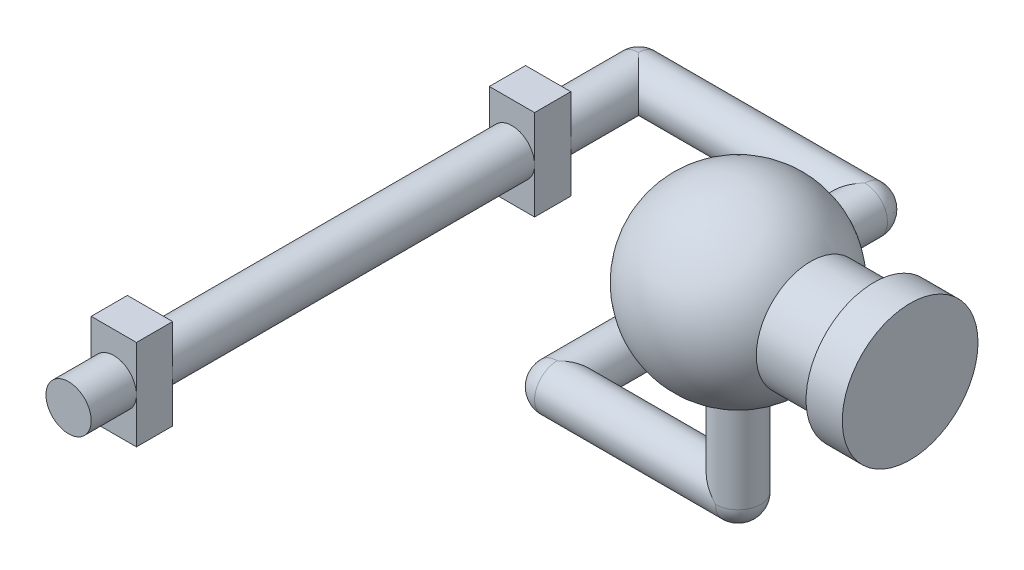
ISO-10303-21;
HEADER;
FILE_DESCRIPTION(('STEP AP214'),'2;1');
FILE_NAME('part.step','',(''),(''),'','','');
FILE_SCHEMA(('AUTOMOTIVE_DESIGN { 1 0 10303 214 1 1 1 1 }'));
ENDSEC;
DATA;
#1=APPLICATION_CONTEXT('core data for automotive mechanical design processes');
#2=APPLICATION_PROTOCOL_DEFINITION('international standard','automotive_design',2000,#1);
#3=PRODUCT_CONTEXT('',#1,'mechanical');
#4=PRODUCT('Part','Part','',(#3));
#5=PRODUCT_RELATED_PRODUCT_CATEGORY('part','',(#4));
#6=PRODUCT_DEFINITION_FORMATION('','',#4);
#7=PRODUCT_DEFINITION_CONTEXT('part definition',#1,'design');
#8=PRODUCT_DEFINITION('design','',#6,#7);
#9=PRODUCT_DEFINITION_SHAPE('','',#8);
#10=(LENGTH_UNIT() NAMED_UNIT(*) SI_UNIT(.MILLI.,.METRE.));
#11=(NAMED_UNIT(*) PLANE_ANGLE_UNIT() SI_UNIT($,.RADIAN.));
#12=(NAMED_UNIT(*) SI_UNIT($,.STERADIAN.) SOLID_ANGLE_UNIT());
#13=UNCERTAINTY_MEASURE_WITH_UNIT(LENGTH_MEASURE(1.E-05),#10,'distance_accuracy_value','');
#14=(GEOMETRIC_REPRESENTATION_CONTEXT(3) GLOBAL_UNCERTAINTY_ASSIGNED_CONTEXT((#13)) GLOBAL_UNIT_ASSIGNED_CONTEXT((#10,
#11,#12)) REPRESENTATION_CONTEXT('',''));
#15=CARTESIAN_POINT('',(0.,0.,0.));
#16=DIRECTION('',(0.,0.,1.));
#17=DIRECTION('',(1.,0.,0.));
#18=AXIS2_PLACEMENT_3D('',#15,#16,#17);
#19=CARTESIAN_POINT('',(45.,20.,-24.));
#20=DIRECTION('',(0.,0.,-1.));
#21=DIRECTION('',(1.,0.,0.));
#22=AXIS2_PLACEMENT_3D('',#19,#20,#21);
#23=SPHERICAL_SURFACE('',#22,10.);
#24=CARTESIAN_POINT('',(53.,20.,-24.));
#25=DIRECTION('',(-1.,0.,0.));
#26=DIRECTION('',(0.,0.,1.));
#27=AXIS2_PLACEMENT_3D('',#24,#25,#26);
#28=CIRCLE('',#27,6.);
#29=CARTESIAN_POINT('',(53.,20.,-18.));
#30=VERTEX_POINT('',#29);
#31=EDGE_CURVE('E452',#30,#30,#28,.F.);
#32=ORIENTED_EDGE('',*,*,#31,.F.);
#33=EDGE_LOOP('',(#32));
#34=FACE_BOUND('',#33,.T.);
#35=CARTESIAN_POINT('',(45.,10.3175416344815,-24.));
#36=DIRECTION('',(0.,1.,0.));
#37=DIRECTION('',(0.,0.,1.));
#38=AXIS2_PLACEMENT_3D('',#35,#36,#37);
#39=CIRCLE('',#38,2.5);
#40=CARTESIAN_POINT('',(45.,10.3175416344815,-21.5));
#41=VERTEX_POINT('',#40);
#42=EDGE_CURVE('E449',#41,#41,#39,.T.);
#43=ORIENTED_EDGE('',*,*,#42,.T.);
#44=EDGE_LOOP('',(#43));
#45=FACE_BOUND('',#44,.T.);
#46=CARTESIAN_POINT('',(45.,15.3639204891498,-24.));
#47=DIRECTION('',(0.,1.,0.));
#48=DIRECTION('',(0.,0.,1.));
#49=AXIS2_PLACEMENT_3D('',#46,#47,#48);
#50=CIRCLE('',#49,8.86040443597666);
#51=CARTESIAN_POINT('',(41.8204007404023,15.3639204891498,-32.2702427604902));
#52=VERTEX_POINT('',#51);
#53=CARTESIAN_POINT('',(40.5164851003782,15.3639204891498,-31.6423073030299));
#54=VERTEX_POINT('',#53);
#55=EDGE_CURVE('E11',#52,#54,#50,.T.);
#56=ORIENTED_EDGE('',*,*,#55,.F.);
#57=CARTESIAN_POINT('',(41.8204007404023,20.,-24.));
#58=DIRECTION('',(-1.,0.,0.));
#59=DIRECTION('',(0.,0.,1.));
#60=AXIS2_PLACEMENT_3D('',#57,#58,#59);
#61=CIRCLE('',#60,9.48104153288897);
#62=CARTESIAN_POINT('',(41.8204007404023,23.187414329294,-32.929195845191));
#63=VERTEX_POINT('',#62);
#64=EDGE_CURVE('E455',#63,#52,#61,.T.);
#65=ORIENTED_EDGE('',*,*,#64,.F.);
#66=CARTESIAN_POINT('',(43.0145541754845,19.3776680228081,-24.));
#67=DIRECTION('',(0.954222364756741,0.299098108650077,0.));
#68=DIRECTION('',(-0.299098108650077,0.954222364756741,0.));
#69=AXIS2_PLACEMENT_3D('',#66,#67,#68);
#70=CIRCLE('',#69,9.78114041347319);
#71=CARTESIAN_POINT('',(44.2726511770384,15.3639204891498,-32.8305000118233));
#72=VERTEX_POINT('',#71);
#73=EDGE_CURVE('E457',#72,#63,#70,.T.);
#74=ORIENTED_EDGE('',*,*,#73,.F.);
#75=CARTESIAN_POINT('',(45.,15.3639204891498,-24.));
#76=DIRECTION('',(0.,1.,0.));
#77=DIRECTION('',(0.,0.,1.));
#78=AXIS2_PLACEMENT_3D('',#75,#76,#77);
#79=CIRCLE('',#78,8.86040443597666);
#80=CARTESIAN_POINT('',(45.6358357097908,15.3639204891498,-32.8375607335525));
#81=VERTEX_POINT('',#80);
#82=EDGE_CURVE('E459',#81,#72,#79,.T.);
#83=ORIENTED_EDGE('',*,*,#82,.F.);
#84=CARTESIAN_POINT('',(46.9080454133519,19.3983152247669,-24.));
#85=DIRECTION('',(-0.953705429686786,0.300742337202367,0.));
#86=DIRECTION('',(-0.300742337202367,-0.953705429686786,0.));
#87=AXIS2_PLACEMENT_3D('',#84,#85,#86);
#88=CIRCLE('',#87,9.79782313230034);
#89=CARTESIAN_POINT('',(48.102903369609,23.187414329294,-32.9561364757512));
#90=VERTEX_POINT('',#89);
#91=EDGE_CURVE('E461',#90,#81,#88,.T.);
#92=ORIENTED_EDGE('',*,*,#91,.F.);
#93=CARTESIAN_POINT('',(48.102903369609,20.,-24.));
#94=DIRECTION('',(1.,0.,0.));
#95=DIRECTION('',(0.,0.,-1.));
#96=AXIS2_PLACEMENT_3D('',#93,#94,#95);
#97=CIRCLE('',#96,9.50641839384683);
#98=CARTESIAN_POINT('',(48.102903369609,15.3639204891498,-32.2993227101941));
#99=VERTEX_POINT('',#98);
#100=EDGE_CURVE('E463',#99,#90,#97,.T.);
#101=ORIENTED_EDGE('',*,*,#100,.F.);
#102=CARTESIAN_POINT('',(45.,15.3639204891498,-24.));
#103=DIRECTION('',(0.,1.,0.));
#104=DIRECTION('',(0.,0.,1.));
#105=AXIS2_PLACEMENT_3D('',#102,#103,#104);
#106=CIRCLE('',#105,8.86040443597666);
#107=CARTESIAN_POINT('',(49.406819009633,15.3639204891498,-31.6867882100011));
#108=VERTEX_POINT('',#107);
#109=EDGE_CURVE('E465',#108,#99,#106,.T.);
#110=ORIENTED_EDGE('',*,*,#109,.F.);
#111=CARTESIAN_POINT('',(49.406819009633,20.,-24.));
#112=DIRECTION('',(-1.,0.,0.));
#113=DIRECTION('',(0.,0.,1.));
#114=AXIS2_PLACEMENT_3D('',#111,#112,#113);
#115=CIRCLE('',#114,8.97663334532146);
#116=CARTESIAN_POINT('',(49.406819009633,24.6098677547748,-31.7025363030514));
#117=VERTEX_POINT('',#116);
#118=EDGE_CURVE('E467',#117,#108,#115,.T.);
#119=ORIENTED_EDGE('',*,*,#118,.F.);
#120=CARTESIAN_POINT('',(45.,24.6098677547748,-24.));
#121=DIRECTION('',(0.,-1.,0.));
#122=DIRECTION('',(0.,0.,-1.));
#123=AXIS2_PLACEMENT_3D('',#120,#121,#122);
#124=CIRCLE('',#123,8.87407005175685);
#125=CARTESIAN_POINT('',(47.4620584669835,24.6098677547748,-32.5256898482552));
#126=VERTEX_POINT('',#125);
#127=EDGE_CURVE('E469',#126,#117,#124,.T.);
#128=ORIENTED_EDGE('',*,*,#127,.F.);
#129=CARTESIAN_POINT('',(45.8908068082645,19.7141035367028,-24.));
#130=DIRECTION('',(0.952163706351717,-0.305588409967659,0.));
#131=DIRECTION('',(0.305588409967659,0.952163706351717,0.));
#132=AXIS2_PLACEMENT_3D('',#129,#130,#131);
#133=CIRCLE('',#132,9.95614013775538);
#134=CARTESIAN_POINT('',(45.4154295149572,18.2329053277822,-33.8338596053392));
#135=VERTEX_POINT('',#134);
#136=EDGE_CURVE('E470',#135,#126,#133,.T.);
#137=ORIENTED_EDGE('',*,*,#136,.F.);
#138=CARTESIAN_POINT('',(44.9616520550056,16.7641480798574,-33.4619126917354));
#139=CARTESIAN_POINT('',(44.9660644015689,16.7791286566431,-33.4670537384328));
#140=CARTESIAN_POINT('',(44.970476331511,16.7941225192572,-33.4721564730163));
#141=CARTESIAN_POINT('',(44.9793212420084,16.8241305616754,-33.4822832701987));
#142=CARTESIAN_POINT('',(44.983754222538,16.8391447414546,-33.4873073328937));
#143=CARTESIAN_POINT('',(44.9971176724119,16.8842087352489,-33.5022585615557));
#144=CARTESIAN_POINT('',(45.006112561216,16.914279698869,-33.5120646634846));
#145=CARTESIAN_POINT('',(45.0242074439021,16.974488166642,-33.5313573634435));
#146=CARTESIAN_POINT('',(45.0333074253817,17.0046256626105,-33.5408439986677));
#147=CARTESIAN_POINT('',(45.0513297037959,17.065044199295,-33.559523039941));
#148=CARTESIAN_POINT('',(45.0602520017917,17.0953252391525,-33.5687154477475));
#149=CARTESIAN_POINT('',(45.0782742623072,17.1559305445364,-33.5867733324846));
#150=CARTESIAN_POINT('',(45.0873742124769,17.1862548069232,-33.5956388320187));
#151=CARTESIAN_POINT('',(45.1060754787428,17.2468510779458,-33.6130120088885));
#152=CARTESIAN_POINT('',(45.1156767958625,17.2771230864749,-33.6215196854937));
#153=CARTESIAN_POINT('',(45.1349712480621,17.3377248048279,-33.6382132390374));
#154=CARTESIAN_POINT('',(45.1446643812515,17.3680545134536,-33.6463991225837));
#155=CARTESIAN_POINT('',(45.1638675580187,17.4288500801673,-33.6624746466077));
#156=CARTESIAN_POINT('',(45.1733776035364,17.4593159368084,-33.6703642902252));
#157=CARTESIAN_POINT('',(45.1923293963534,17.5205412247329,-33.685885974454));
#158=CARTESIAN_POINT('',(45.2017704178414,17.5513013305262,-33.6935162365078));
#159=CARTESIAN_POINT('',(45.2205693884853,17.6129219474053,-33.7084654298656));
#160=CARTESIAN_POINT('',(45.2299273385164,17.6437824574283,-33.7157843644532));
#161=CARTESIAN_POINT('',(45.2487561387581,17.7055451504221,-33.7300920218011));
#162=CARTESIAN_POINT('',(45.2582269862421,17.7364473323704,-33.7370807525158));
#163=CARTESIAN_POINT('',(45.2774910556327,17.7982286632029,-33.7507074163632));
#164=CARTESIAN_POINT('',(45.2872842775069,17.8291078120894,-33.7573453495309));
#165=CARTESIAN_POINT('',(45.307055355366,17.8909327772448,-33.7702942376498));
#166=CARTESIAN_POINT('',(45.3170334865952,17.9218786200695,-33.7766046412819));
#167=CARTESIAN_POINT('',(45.3369289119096,17.9838529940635,-33.7889083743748));
#168=CARTESIAN_POINT('',(45.3468462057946,18.0148815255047,-33.7949017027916));
#169=CARTESIAN_POINT('',(45.3665603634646,18.077036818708,-33.8065765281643));
#170=CARTESIAN_POINT('',(45.3763572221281,18.1081635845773,-33.8122580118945));
#171=CARTESIAN_POINT('',(45.3959070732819,18.1704879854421,-33.8233008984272));
#172=CARTESIAN_POINT('',(45.4056600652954,18.2016856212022,-33.8286622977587));
#173=CARTESIAN_POINT('',(45.4154295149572,18.2329053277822,-33.8338596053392));
#174=B_SPLINE_CURVE_WITH_KNOTS('',3,(#138,#139,#140,#141,#142,#143,#144,#145,#146,#147,#148,
#149,#150,#151,#152,#153,#154,#155,#156,#157,#158,#159,#160,#161,#162,#163,#164,#165,#166,#167,
#168,#169,#170,#171,#172,#173),.UNSPECIFIED.,.F.,.F.,(4,2,2,2,2,2,2,2,2,2,2,2,2,2,2,2,2,4),(0.,
0.0493239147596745,0.0986477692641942,0.197296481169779,0.295933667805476,0.394570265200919,
0.493200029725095,0.591829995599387,0.690457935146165,0.789084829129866,0.88828913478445,
0.987492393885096,1.08669326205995,1.18589412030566,1.28525687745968,1.38461996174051,
1.48398725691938,1.5833556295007),.UNSPECIFIED.);
#175=CARTESIAN_POINT('',(44.9616520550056,16.7641480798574,-33.4619126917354));
#176=VERTEX_POINT('',#175);
#177=EDGE_CURVE('E338',#176,#135,#174,.T.);
#178=ORIENTED_EDGE('',*,*,#177,.F.);
#179=CARTESIAN_POINT('',(44.5449176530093,18.1217761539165,-33.8114818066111));
#180=CARTESIAN_POINT('',(44.5537796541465,18.0931494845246,-33.8064128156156));
#181=CARTESIAN_POINT('',(44.5626317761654,18.0645441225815,-33.8012062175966));
#182=CARTESIAN_POINT('',(44.5803554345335,18.0073903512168,-33.7905224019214));
#183=CARTESIAN_POINT('',(44.5892269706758,17.9788419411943,-33.7850451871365));
#184=CARTESIAN_POINT('',(44.6070293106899,17.9218142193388,-33.7738243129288));
#185=CARTESIAN_POINT('',(44.6159601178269,17.8933349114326,-33.7680806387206));
#186=CARTESIAN_POINT('',(44.6338739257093,17.836447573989,-33.7563269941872));
#187=CARTESIAN_POINT('',(44.6428569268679,17.8080395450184,-33.7503170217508));
#188=CARTESIAN_POINT('',(44.6653115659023,17.7369551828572,-33.7349218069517));
#189=CARTESIAN_POINT('',(44.6787618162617,17.6943094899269,-33.7253631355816));
#190=CARTESIAN_POINT('',(44.7054295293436,17.6090921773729,-33.7056106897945));
#191=CARTESIAN_POINT('',(44.7186469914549,17.566520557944,-33.6954169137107));
#192=CARTESIAN_POINT('',(44.7447869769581,17.4814441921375,-33.6743906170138));
#193=CARTESIAN_POINT('',(44.7577094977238,17.4389394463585,-33.6635580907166));
#194=CARTESIAN_POINT('',(44.7771010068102,17.3753044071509,-33.6468550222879));
#195=CARTESIAN_POINT('',(44.7835661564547,17.3541129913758,-33.641211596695));
#196=CARTESIAN_POINT('',(44.7965513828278,17.3117863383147,-33.6297787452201));
#197=CARTESIAN_POINT('',(44.8030714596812,17.2906511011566,-33.6239893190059));
#198=CARTESIAN_POINT('',(44.8161162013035,17.2483500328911,-33.6122388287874));
#199=CARTESIAN_POINT('',(44.8226408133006,17.2271843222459,-33.6062772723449));
#200=CARTESIAN_POINT('',(44.8355760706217,17.1848646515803,-33.5941911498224));
#201=CARTESIAN_POINT('',(44.841986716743,17.1637106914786,-33.5880665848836));
#202=CARTESIAN_POINT('',(44.8546876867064,17.1214147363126,-33.5756544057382));
#203=CARTESIAN_POINT('',(44.8609780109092,17.1002727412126,-33.5693667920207));
#204=CARTESIAN_POINT('',(44.8735928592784,17.058043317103,-33.556643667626));
#205=CARTESIAN_POINT('',(44.8799173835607,17.0369558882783,-33.5502081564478));
#206=CARTESIAN_POINT('',(44.8927147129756,16.994867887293,-33.537200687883));
#207=CARTESIAN_POINT('',(44.8991875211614,16.9738673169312,-33.5306287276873));
#208=CARTESIAN_POINT('',(44.912091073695,16.9319022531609,-33.5173302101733));
#209=CARTESIAN_POINT('',(44.9185218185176,16.9109377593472,-33.510603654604));
#210=CARTESIAN_POINT('',(44.9311389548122,16.8689923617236,-33.4969771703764));
#211=CARTESIAN_POINT('',(44.9373253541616,16.848011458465,-33.490077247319));
#212=CARTESIAN_POINT('',(44.9495630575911,16.8060620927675,-33.4761143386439));
#213=CARTESIAN_POINT('',(44.9556143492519,16.7850936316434,-33.4690513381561));
#214=CARTESIAN_POINT('',(44.9616520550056,16.7641480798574,-33.4619126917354));
#215=B_SPLINE_CURVE_WITH_KNOTS('',3,(#179,#180,#181,#182,#183,#184,#185,#186,#187,#188,#189,
#190,#191,#192,#193,#194,#195,#196,#197,#198,#199,#200,#201,#202,#203,#204,#205,#206,#207,#208,
#209,#210,#211,#212,#213,#214),.UNSPECIFIED.,.F.,.F.,(4,2,2,2,2,2,2,2,2,2,2,2,2,2,2,2,2,4),(0.,
0.0911777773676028,0.18235458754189,0.273536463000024,0.364719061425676,0.501894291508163,
0.639069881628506,0.776246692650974,0.844835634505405,0.913424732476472,0.982234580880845,
1.05104394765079,1.1198531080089,1.18866250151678,1.25747331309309,1.32628334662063,
1.39509116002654,1.46390527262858),.UNSPECIFIED.);
#216=CARTESIAN_POINT('',(44.5449176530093,18.1217761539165,-33.8114818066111));
#217=VERTEX_POINT('',#216);
#218=EDGE_CURVE('E330',#217,#176,#215,.T.);
#219=ORIENTED_EDGE('',*,*,#218,.F.);
#220=CARTESIAN_POINT('',(44.0436145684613,19.69531083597,-24.));
#221=DIRECTION('',(-0.95281497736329,-0.303551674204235,0.));
#222=DIRECTION('',(0.303551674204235,-0.95281497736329,0.));
#223=AXIS2_PLACEMENT_3D('',#220,#221,#222);
#224=CIRCLE('',#223,9.94949704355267);
#225=CARTESIAN_POINT('',(42.4779150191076,24.6098677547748,-32.5081259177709));
#226=VERTEX_POINT('',#225);
#227=EDGE_CURVE('E337',#226,#217,#224,.T.);
#228=ORIENTED_EDGE('',*,*,#227,.F.);
#229=CARTESIAN_POINT('',(45.,24.6098677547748,-24.));
#230=DIRECTION('',(0.,-1.,0.));
#231=DIRECTION('',(0.,0.,-1.));
#232=AXIS2_PLACEMENT_3D('',#229,#230,#231);
#233=CIRCLE('',#232,8.87407005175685);
#234=CARTESIAN_POINT('',(40.5164851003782,24.6098677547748,-31.6581468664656));
#235=VERTEX_POINT('',#234);
#236=EDGE_CURVE('E906',#235,#226,#233,.T.);
#237=ORIENTED_EDGE('',*,*,#236,.F.);
#238=CARTESIAN_POINT('',(40.5164851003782,20.,-24.));
#239=DIRECTION('',(1.,0.,0.));
#240=DIRECTION('',(0.,0.,-1.));
#241=AXIS2_PLACEMENT_3D('',#238,#239,#240);
#242=CIRCLE('',#241,8.93857338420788);
#243=EDGE_CURVE('E40',#54,#235,#242,.T.);
#244=ORIENTED_EDGE('',*,*,#243,.F.);
#245=EDGE_LOOP('',(#56,#65,#74,#83,#92,#101,#110,#119,#128,#137,#178,#219,#228,#237,#244));
#246=FACE_BOUND('',#245,.T.);
#247=ADVANCED_FACE('F32',(#34,#45,#246),#23,.T.);
#248=CARTESIAN_POINT('',(45.,20.,-24.));
#249=DIRECTION('',(0.,-1.,0.));
#250=DIRECTION('',(0.,0.,-1.));
#251=AXIS2_PLACEMENT_3D('',#248,#249,#250);
#252=CYLINDRICAL_SURFACE('',#251,2.5);
#253=CARTESIAN_POINT('',(45.,0.,-24.));
#254=DIRECTION('',(0.,1.,0.));
#255=DIRECTION('',(0.,0.,1.));
#256=AXIS2_PLACEMENT_3D('',#253,#254,#255);
#257=CIRCLE('',#256,2.5);
#258=CARTESIAN_POINT('',(45.,0.,-21.5));
#259=VERTEX_POINT('',#258);
#260=CARTESIAN_POINT('',(45.,0.,-26.5));
#261=VERTEX_POINT('',#260);
#262=EDGE_CURVE('E520',#259,#261,#257,.T.);
#263=ORIENTED_EDGE('',*,*,#262,.T.);
#264=CARTESIAN_POINT('',(45.,0.,-24.));
#265=DIRECTION('',(-0.707106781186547,-0.707106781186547,0.));
#266=DIRECTION('',(-0.707106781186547,0.707106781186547,0.));
#267=AXIS2_PLACEMENT_3D('',#264,#265,#266);
#268=ELLIPSE('',#267,3.53553390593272,2.49999999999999);
#269=EDGE_CURVE('E523',#261,#259,#268,.F.);
#270=ORIENTED_EDGE('',*,*,#269,.T.);
#271=EDGE_LOOP('',(#263,#270));
#272=FACE_BOUND('',#271,.T.);
#273=ORIENTED_EDGE('',*,*,#42,.F.);
#274=EDGE_LOOP('',(#273));
#275=FACE_BOUND('',#274,.T.);
#276=ADVANCED_FACE('F348',(#272,#275),#252,.T.);
#277=CARTESIAN_POINT('',(45.,0.,-24.));
#278=DIRECTION('',(-1.,0.,0.));
#279=DIRECTION('',(0.,0.,1.));
#280=AXIS2_PLACEMENT_3D('',#277,#278,#279);
#281=CYLINDRICAL_SURFACE('',#280,2.49999999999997);
#282=CARTESIAN_POINT('',(25.,0.,-24.));
#283=DIRECTION('',(-0.707106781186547,0.,-0.707106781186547));
#284=DIRECTION('',(0.707106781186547,0.,-0.707106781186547));
#285=AXIS2_PLACEMENT_3D('',#282,#283,#284);
#286=ELLIPSE('',#285,3.53553390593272,2.49999999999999);
#287=CARTESIAN_POINT('',(25.,2.49999999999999,-24.));
#288=VERTEX_POINT('',#287);
#289=CARTESIAN_POINT('',(25.,-2.49999999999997,-24.));
#290=VERTEX_POINT('',#289);
#291=EDGE_CURVE('E531',#288,#290,#286,.T.);
#292=ORIENTED_EDGE('',*,*,#291,.F.);
#293=CARTESIAN_POINT('',(25.,0.,-24.));
#294=DIRECTION('',(1.,0.,0.));
#295=DIRECTION('',(0.,0.,-1.));
#296=AXIS2_PLACEMENT_3D('',#293,#294,#295);
#297=CIRCLE('',#296,2.49999999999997);
#298=EDGE_CURVE('E526',#288,#290,#297,.T.);
#299=ORIENTED_EDGE('',*,*,#298,.T.);
#300=EDGE_LOOP('',(#292,#299));
#301=FACE_BOUND('',#300,.T.);
#302=ORIENTED_EDGE('',*,*,#269,.F.);
#303=CARTESIAN_POINT('',(45.,0.,-24.));
#304=DIRECTION('',(1.,0.,0.));
#305=DIRECTION('',(0.,0.,-1.));
#306=AXIS2_PLACEMENT_3D('',#303,#304,#305);
#307=CIRCLE('',#306,2.49999999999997);
#308=EDGE_CURVE('E529',#259,#261,#307,.T.);
#309=ORIENTED_EDGE('',*,*,#308,.F.);
#310=EDGE_LOOP('',(#302,#309));
#311=FACE_BOUND('',#310,.T.);
#312=ADVANCED_FACE('F355',(#301,#311),#281,.T.);
#313=CARTESIAN_POINT('',(25.,0.,-24.));
#314=DIRECTION('',(0.,0.,-1.));
#315=DIRECTION('',(-1.,0.,0.));
#316=AXIS2_PLACEMENT_3D('',#313,#314,#315);
#317=CYLINDRICAL_SURFACE('',#316,2.5);
#318=CARTESIAN_POINT('',(25.,0.,-58.));
#319=DIRECTION('',(-0.707106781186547,0.,-0.707106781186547));
#320=DIRECTION('',(-0.707106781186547,0.,0.707106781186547));
#321=AXIS2_PLACEMENT_3D('',#318,#319,#320);
#322=ELLIPSE('',#321,3.53553390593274,2.5);
#323=CARTESIAN_POINT('',(25.,-2.5,-58.));
#324=VERTEX_POINT('',#323);
#325=CARTESIAN_POINT('',(25.,2.5,-58.));
#326=VERTEX_POINT('',#325);
#327=EDGE_CURVE('E540',#324,#326,#322,.T.);
#328=ORIENTED_EDGE('',*,*,#327,.F.);
#329=CARTESIAN_POINT('',(25.,0.,-58.));
#330=DIRECTION('',(0.,0.,-1.));
#331=DIRECTION('',(-1.,0.,0.));
#332=AXIS2_PLACEMENT_3D('',#329,#330,#331);
#333=CIRCLE('',#332,2.5);
#334=EDGE_CURVE('E534',#326,#324,#333,.T.);
#335=ORIENTED_EDGE('',*,*,#334,.F.);
#336=EDGE_LOOP('',(#328,#335));
#337=FACE_BOUND('',#336,.T.);
#338=CARTESIAN_POINT('',(25.,0.,-24.));
#339=DIRECTION('',(0.,0.,-1.));
#340=DIRECTION('',(-1.,0.,0.));
#341=AXIS2_PLACEMENT_3D('',#338,#339,#340);
#342=CIRCLE('',#341,2.5);
#343=EDGE_CURVE('E537',#290,#288,#342,.T.);
#344=ORIENTED_EDGE('',*,*,#343,.T.);
#345=ORIENTED_EDGE('',*,*,#291,.T.);
#346=EDGE_LOOP('',(#344,#345));
#347=FACE_BOUND('',#346,.T.);
#348=ADVANCED_FACE('F359',(#337,#347),#317,.T.);
#349=CARTESIAN_POINT('',(0.,0.,-58.));
#350=DIRECTION('',(0.,0.,1.));
#351=DIRECTION('',(1.,0.,0.));
#352=AXIS2_PLACEMENT_3D('',#349,#350,#351);
#353=CYLINDRICAL_SURFACE('',#352,2.5);
#354=CARTESIAN_POINT('',(0.,0.,-48.));
#355=DIRECTION('',(0.,0.,-1.));
#356=DIRECTION('',(-1.,0.,0.));
#357=AXIS2_PLACEMENT_3D('',#354,#355,#356);
#358=CIRCLE('',#357,2.5);
#359=CARTESIAN_POINT('',(-2.5,0.,-48.));
#360=VERTEX_POINT('',#359);
#361=CARTESIAN_POINT('',(2.5,0.,-48.));
#362=VERTEX_POINT('',#361);
#363=EDGE_CURVE('E551',#360,#362,#358,.T.);
#364=ORIENTED_EDGE('',*,*,#363,.T.);
#365=EDGE_CURVE('E55',#362,#360,#358,.T.);
#366=ORIENTED_EDGE('',*,*,#365,.T.);
#367=EDGE_LOOP('',(#364,#366));
#368=FACE_BOUND('',#367,.T.);
#369=CARTESIAN_POINT('',(0.,0.,-58.));
#370=DIRECTION('',(-0.707106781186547,0.,0.707106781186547));
#371=DIRECTION('',(0.707106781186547,0.,0.707106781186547));
#372=AXIS2_PLACEMENT_3D('',#369,#370,#371);
#373=ELLIPSE('',#372,3.53553390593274,2.5);
#374=CARTESIAN_POINT('',(0.,2.5,-58.));
#375=VERTEX_POINT('',#374);
#376=CARTESIAN_POINT('',(0.,-2.5,-58.));
#377=VERTEX_POINT('',#376);
#378=EDGE_CURVE('E548',#375,#377,#373,.F.);
#379=ORIENTED_EDGE('',*,*,#378,.F.);
#380=CARTESIAN_POINT('',(0.,0.,-58.));
#381=DIRECTION('',(0.,0.,-1.));
#382=DIRECTION('',(-1.,0.,0.));
#383=AXIS2_PLACEMENT_3D('',#380,#381,#382);
#384=CIRCLE('',#383,2.5);
#385=EDGE_CURVE('E554',#377,#375,#384,.T.);
#386=ORIENTED_EDGE('',*,*,#385,.F.);
#387=EDGE_LOOP('',(#379,#386));
#388=FACE_BOUND('',#387,.T.);
#389=ADVANCED_FACE('F363',(#368,#388),#353,.T.);
#390=CARTESIAN_POINT('',(2.5,-5.,-48.));
#391=DIRECTION('',(0.,0.,-1.));
#392=DIRECTION('',(-1.,0.,0.));
#393=AXIS2_PLACEMENT_3D('',#390,#391,#392);
#394=PLANE('',#393);
#395=ORIENTED_EDGE('',*,*,#363,.F.);
#396=DIRECTION('',(0.,1.,0.));
#397=VECTOR('',#396,1.);
#398=CARTESIAN_POINT('',(-2.5,5.,-48.));
#399=LINE('',#398,#397);
#400=CARTESIAN_POINT('',(-2.5,5.,-48.));
#401=VERTEX_POINT('',#400);
#402=EDGE_CURVE('E574',#360,#401,#399,.T.);
#403=ORIENTED_EDGE('',*,*,#402,.T.);
#404=DIRECTION('',(1.,0.,0.));
#405=VECTOR('',#404,1.);
#406=CARTESIAN_POINT('',(2.5,5.,-48.));
#407=LINE('',#406,#405);
#408=CARTESIAN_POINT('',(2.5,5.,-48.));
#409=VERTEX_POINT('',#408);
#410=EDGE_CURVE('E577',#401,#409,#407,.T.);
#411=ORIENTED_EDGE('',*,*,#410,.T.);
#412=DIRECTION('',(0.,-1.,0.));
#413=VECTOR('',#412,1.);
#414=CARTESIAN_POINT('',(2.5,5.,-48.));
#415=LINE('',#414,#413);
#416=EDGE_CURVE('E569',#409,#362,#415,.T.);
#417=ORIENTED_EDGE('',*,*,#416,.T.);
#418=EDGE_LOOP('',(#395,#403,#411,#417));
#419=FACE_BOUND('',#418,.T.);
#420=ADVANCED_FACE('F372',(#419),#394,.T.);
#421=CARTESIAN_POINT('',(2.5,-5.,-4.));
#422=DIRECTION('',(0.,0.,-1.));
#423=DIRECTION('',(-1.,0.,0.));
#424=AXIS2_PLACEMENT_3D('',#421,#422,#423);
#425=PLANE('',#424);
#426=CARTESIAN_POINT('',(0.,0.,-4.));
#427=DIRECTION('',(0.,0.,-1.));
#428=DIRECTION('',(-1.,0.,0.));
#429=AXIS2_PLACEMENT_3D('',#426,#427,#428);
#430=CIRCLE('',#429,2.5);
#431=CARTESIAN_POINT('',(-2.5,0.,-4.));
#432=VERTEX_POINT('',#431);
#433=CARTESIAN_POINT('',(2.5,0.,-4.));
#434=VERTEX_POINT('',#433);
#435=EDGE_CURVE('E443',#432,#434,#430,.T.);
#436=ORIENTED_EDGE('',*,*,#435,.F.);
#437=DIRECTION('',(0.,1.,0.));
#438=VECTOR('',#437,1.);
#439=CARTESIAN_POINT('',(-2.5,5.,-4.));
#440=LINE('',#439,#438);
#441=CARTESIAN_POINT('',(-2.5,5.,-4.));
#442=VERTEX_POINT('',#441);
#443=EDGE_CURVE('E613',#432,#442,#440,.T.);
#444=ORIENTED_EDGE('',*,*,#443,.T.);
#445=DIRECTION('',(1.,0.,0.));
#446=VECTOR('',#445,1.);
#447=CARTESIAN_POINT('',(2.5,5.,-4.));
#448=LINE('',#447,#446);
#449=CARTESIAN_POINT('',(2.5,5.,-4.));
#450=VERTEX_POINT('',#449);
#451=EDGE_CURVE('E616',#442,#450,#448,.T.);
#452=ORIENTED_EDGE('',*,*,#451,.T.);
#453=DIRECTION('',(0.,-1.,0.));
#454=VECTOR('',#453,1.);
#455=CARTESIAN_POINT('',(2.5,5.,-4.));
#456=LINE('',#455,#454);
#457=EDGE_CURVE('E608',#450,#434,#456,.T.);
#458=ORIENTED_EDGE('',*,*,#457,.T.);
#459=EDGE_LOOP('',(#436,#444,#452,#458));
#460=FACE_BOUND('',#459,.T.);
#461=ADVANCED_FACE('F411',(#460),#425,.T.);
#462=CARTESIAN_POINT('',(0.,0.,5.));
#463=DIRECTION('',(0.,0.,-1.));
#464=DIRECTION('',(-1.,0.,0.));
#465=AXIS2_PLACEMENT_3D('',#462,#463,#464);
#466=CYLINDRICAL_SURFACE('',#465,2.5);
#467=CARTESIAN_POINT('',(0.,0.,5.));
#468=DIRECTION('',(0.,0.,1.));
#469=DIRECTION('',(1.,0.,0.));
#470=AXIS2_PLACEMENT_3D('',#467,#468,#469);
#471=CIRCLE('',#470,2.5);
#472=CARTESIAN_POINT('',(2.5,0.,5.));
#473=VERTEX_POINT('',#472);
#474=EDGE_CURVE('E437',#473,#473,#471,.T.);
#475=ORIENTED_EDGE('',*,*,#474,.F.);
#476=EDGE_LOOP('',(#475));
#477=FACE_BOUND('',#476,.T.);
#478=CARTESIAN_POINT('',(0.,0.,0.));
#479=DIRECTION('',(0.,0.,1.));
#480=DIRECTION('',(1.,0.,0.));
#481=AXIS2_PLACEMENT_3D('',#478,#479,#480);
#482=CIRCLE('',#481,2.5);
#483=CARTESIAN_POINT('',(2.5,0.,0.));
#484=VERTEX_POINT('',#483);
#485=CARTESIAN_POINT('',(-2.5,0.,0.));
#486=VERTEX_POINT('',#485);
#487=EDGE_CURVE('E439',#484,#486,#482,.T.);
#488=ORIENTED_EDGE('',*,*,#487,.T.);
#489=EDGE_CURVE('E445',#486,#484,#482,.T.);
#490=ORIENTED_EDGE('',*,*,#489,.T.);
#491=EDGE_LOOP('',(#488,#490));
#492=FACE_BOUND('',#491,.T.);
#493=ADVANCED_FACE('F34',(#477,#492),#466,.T.);
#494=CARTESIAN_POINT('',(0.,0.,5.));
#495=DIRECTION('',(0.,0.,1.));
#496=DIRECTION('',(1.,0.,0.));
#497=AXIS2_PLACEMENT_3D('',#494,#495,#496);
#498=PLANE('',#497);
#499=ORIENTED_EDGE('',*,*,#474,.T.);
#500=EDGE_LOOP('',(#499));
#501=FACE_BOUND('',#500,.T.);
#502=ADVANCED_FACE('F426',(#501),#498,.T.);
#503=CARTESIAN_POINT('',(2.5,-5.,0.));
#504=DIRECTION('',(0.,0.,-1.));
#505=DIRECTION('',(-1.,0.,0.));
#506=AXIS2_PLACEMENT_3D('',#503,#504,#505);
#507=PLANE('',#506);
#508=ORIENTED_EDGE('',*,*,#487,.F.);
#509=DIRECTION('',(0.,-1.,0.));
#510=VECTOR('',#509,1.);
#511=CARTESIAN_POINT('',(2.5,5.,0.));
#512=LINE('',#511,#510);
#513=CARTESIAN_POINT('',(2.5,5.,0.));
#514=VERTEX_POINT('',#513);
#515=EDGE_CURVE('E597',#514,#484,#512,.T.);
#516=ORIENTED_EDGE('',*,*,#515,.F.);
#517=DIRECTION('',(1.,0.,0.));
#518=VECTOR('',#517,1.);
#519=CARTESIAN_POINT('',(2.5,5.,0.));
#520=LINE('',#519,#518);
#521=CARTESIAN_POINT('',(-2.5,5.,0.));
#522=VERTEX_POINT('',#521);
#523=EDGE_CURVE('E605',#522,#514,#520,.T.);
#524=ORIENTED_EDGE('',*,*,#523,.F.);
#525=DIRECTION('',(0.,1.,0.));
#526=VECTOR('',#525,1.);
#527=CARTESIAN_POINT('',(-2.5,5.,0.));
#528=LINE('',#527,#526);
#529=EDGE_CURVE('E601',#486,#522,#528,.T.);
#530=ORIENTED_EDGE('',*,*,#529,.F.);
#531=EDGE_LOOP('',(#508,#516,#524,#530));
#532=FACE_BOUND('',#531,.T.);
#533=ADVANCED_FACE('F406',(#532),#507,.F.);
#534=CARTESIAN_POINT('',(2.5,5.,-4.));
#535=DIRECTION('',(-1.,0.,0.));
#536=DIRECTION('',(0.,-1.,0.));
#537=AXIS2_PLACEMENT_3D('',#534,#535,#536);
#538=PLANE('',#537);
#539=ORIENTED_EDGE('',*,*,#515,.T.);
#540=CARTESIAN_POINT('',(2.5,-5.,0.));
#541=VERTEX_POINT('',#540);
#542=EDGE_CURVE('E596',#484,#541,#512,.T.);
#543=ORIENTED_EDGE('',*,*,#542,.T.);
#544=DIRECTION('',(0.,0.,1.));
#545=VECTOR('',#544,1.);
#546=CARTESIAN_POINT('',(2.5,-5.,-4.));
#547=LINE('',#546,#545);
#548=CARTESIAN_POINT('',(2.5,-5.,-4.));
#549=VERTEX_POINT('',#548);
#550=EDGE_CURVE('E626',#549,#541,#547,.T.);
#551=ORIENTED_EDGE('',*,*,#550,.F.);
#552=EDGE_CURVE('E607',#434,#549,#456,.T.);
#553=ORIENTED_EDGE('',*,*,#552,.F.);
#554=ORIENTED_EDGE('',*,*,#457,.F.);
#555=DIRECTION('',(0.,0.,1.));
#556=VECTOR('',#555,1.);
#557=CARTESIAN_POINT('',(2.5,5.,-4.));
#558=LINE('',#557,#556);
#559=EDGE_CURVE('E618',#450,#514,#558,.T.);
#560=ORIENTED_EDGE('',*,*,#559,.T.);
#561=EDGE_LOOP('',(#539,#543,#551,#553,#554,#560));
#562=FACE_BOUND('',#561,.T.);
#563=ADVANCED_FACE('F422',(#562),#538,.F.);
#564=CARTESIAN_POINT('',(2.5,-5.,-4.));
#565=DIRECTION('',(0.,1.,0.));
#566=DIRECTION('',(0.,0.,1.));
#567=AXIS2_PLACEMENT_3D('',#564,#565,#566);
#568=PLANE('',#567);
#569=DIRECTION('',(-1.,0.,0.));
#570=VECTOR('',#569,1.);
#571=CARTESIAN_POINT('',(2.5,-5.,0.));
#572=LINE('',#571,#570);
#573=CARTESIAN_POINT('',(-2.5,-5.,0.));
#574=VERTEX_POINT('',#573);
#575=EDGE_CURVE('E599',#541,#574,#572,.T.);
#576=ORIENTED_EDGE('',*,*,#575,.T.);
#577=DIRECTION('',(0.,0.,1.));
#578=VECTOR('',#577,1.);
#579=CARTESIAN_POINT('',(-2.5,-5.,-4.));
#580=LINE('',#579,#578);
#581=CARTESIAN_POINT('',(-2.5,-5.,-4.));
#582=VERTEX_POINT('',#581);
#583=EDGE_CURVE('E624',#582,#574,#580,.T.);
#584=ORIENTED_EDGE('',*,*,#583,.F.);
#585=DIRECTION('',(-1.,0.,0.));
#586=VECTOR('',#585,1.);
#587=CARTESIAN_POINT('',(2.5,-5.,-4.));
#588=LINE('',#587,#586);
#589=EDGE_CURVE('E611',#549,#582,#588,.T.);
#590=ORIENTED_EDGE('',*,*,#589,.F.);
#591=ORIENTED_EDGE('',*,*,#550,.T.);
#592=EDGE_LOOP('',(#576,#584,#590,#591));
#593=FACE_BOUND('',#592,.T.);
#594=ADVANCED_FACE('F418',(#593),#568,.F.);
#595=CARTESIAN_POINT('',(-2.5,5.,-4.));
#596=DIRECTION('',(1.,0.,0.));
#597=DIRECTION('',(0.,1.,0.));
#598=AXIS2_PLACEMENT_3D('',#595,#596,#597);
#599=PLANE('',#598);
#600=EDGE_CURVE('E602',#574,#486,#528,.T.);
#601=ORIENTED_EDGE('',*,*,#600,.T.);
#602=ORIENTED_EDGE('',*,*,#529,.T.);
#603=DIRECTION('',(0.,0.,1.));
#604=VECTOR('',#603,1.);
#605=CARTESIAN_POINT('',(-2.5,5.,-4.));
#606=LINE('',#605,#604);
#607=EDGE_CURVE('E621',#442,#522,#606,.T.);
#608=ORIENTED_EDGE('',*,*,#607,.F.);
#609=ORIENTED_EDGE('',*,*,#443,.F.);
#610=EDGE_CURVE('E614',#582,#432,#440,.T.);
#611=ORIENTED_EDGE('',*,*,#610,.F.);
#612=ORIENTED_EDGE('',*,*,#583,.T.);
#613=EDGE_LOOP('',(#601,#602,#608,#609,#611,#612));
#614=FACE_BOUND('',#613,.T.);
#615=ADVANCED_FACE('F414',(#614),#599,.F.);
#616=CARTESIAN_POINT('',(2.5,5.,-4.));
#617=DIRECTION('',(0.,-1.,0.));
#618=DIRECTION('',(0.,0.,-1.));
#619=AXIS2_PLACEMENT_3D('',#616,#617,#618);
#620=PLANE('',#619);
#621=ORIENTED_EDGE('',*,*,#523,.T.);
#622=ORIENTED_EDGE('',*,*,#559,.F.);
#623=ORIENTED_EDGE('',*,*,#451,.F.);
#624=ORIENTED_EDGE('',*,*,#607,.T.);
#625=EDGE_LOOP('',(#621,#622,#623,#624));
#626=FACE_BOUND('',#625,.T.);
#627=ADVANCED_FACE('F409',(#626),#620,.F.);
#628=EDGE_CURVE('E438',#434,#432,#430,.T.);
#629=ORIENTED_EDGE('',*,*,#628,.F.);
#630=ORIENTED_EDGE('',*,*,#552,.T.);
#631=ORIENTED_EDGE('',*,*,#589,.T.);
#632=ORIENTED_EDGE('',*,*,#610,.T.);
#633=EDGE_LOOP('',(#629,#630,#631,#632));
#634=FACE_BOUND('',#633,.T.);
#635=ADVANCED_FACE('F404',(#634),#425,.T.);
#636=ORIENTED_EDGE('',*,*,#489,.F.);
#637=ORIENTED_EDGE('',*,*,#600,.F.);
#638=ORIENTED_EDGE('',*,*,#575,.F.);
#639=ORIENTED_EDGE('',*,*,#542,.F.);
#640=EDGE_LOOP('',(#636,#637,#638,#639));
#641=FACE_BOUND('',#640,.T.);
#642=ADVANCED_FACE('F400',(#641),#507,.F.);
#643=CARTESIAN_POINT('',(0.,0.,-44.));
#644=DIRECTION('',(0.,0.,1.));
#645=DIRECTION('',(1.,0.,0.));
#646=AXIS2_PLACEMENT_3D('',#643,#644,#645);
#647=CYLINDRICAL_SURFACE('',#646,2.5);
#648=ORIENTED_EDGE('',*,*,#435,.T.);
#649=ORIENTED_EDGE('',*,*,#628,.T.);
#650=EDGE_LOOP('',(#648,#649));
#651=FACE_BOUND('',#650,.T.);
#652=CARTESIAN_POINT('',(0.,0.,-44.));
#653=DIRECTION('',(0.,0.,-1.));
#654=DIRECTION('',(-1.,0.,0.));
#655=AXIS2_PLACEMENT_3D('',#652,#653,#654);
#656=CIRCLE('',#655,2.5);
#657=CARTESIAN_POINT('',(-2.5,0.,-44.));
#658=VERTEX_POINT('',#657);
#659=CARTESIAN_POINT('',(2.5,0.,-44.));
#660=VERTEX_POINT('',#659);
#661=EDGE_CURVE('E593',#658,#660,#656,.T.);
#662=ORIENTED_EDGE('',*,*,#661,.F.);
#663=EDGE_CURVE('E592',#660,#658,#656,.T.);
#664=ORIENTED_EDGE('',*,*,#663,.F.);
#665=EDGE_LOOP('',(#662,#664));
#666=FACE_BOUND('',#665,.T.);
#667=ADVANCED_FACE('F378',(#651,#666),#647,.T.);
#668=CARTESIAN_POINT('',(2.5,-5.,-44.));
#669=DIRECTION('',(0.,0.,-1.));
#670=DIRECTION('',(-1.,0.,0.));
#671=AXIS2_PLACEMENT_3D('',#668,#669,#670);
#672=PLANE('',#671);
#673=DIRECTION('',(0.,1.,0.));
#674=VECTOR('',#673,1.);
#675=CARTESIAN_POINT('',(-2.5,5.,-44.));
#676=LINE('',#675,#674);
#677=CARTESIAN_POINT('',(-2.5,5.,-44.));
#678=VERTEX_POINT('',#677);
#679=EDGE_CURVE('E562',#658,#678,#676,.T.);
#680=ORIENTED_EDGE('',*,*,#679,.F.);
#681=ORIENTED_EDGE('',*,*,#661,.T.);
#682=DIRECTION('',(0.,-1.,0.));
#683=VECTOR('',#682,1.);
#684=CARTESIAN_POINT('',(2.5,5.,-44.));
#685=LINE('',#684,#683);
#686=CARTESIAN_POINT('',(2.5,5.,-44.));
#687=VERTEX_POINT('',#686);
#688=EDGE_CURVE('E557',#687,#660,#685,.T.);
#689=ORIENTED_EDGE('',*,*,#688,.F.);
#690=DIRECTION('',(1.,0.,0.));
#691=VECTOR('',#690,1.);
#692=CARTESIAN_POINT('',(2.5,5.,-44.));
#693=LINE('',#692,#691);
#694=EDGE_CURVE('E566',#678,#687,#693,.T.);
#695=ORIENTED_EDGE('',*,*,#694,.F.);
#696=EDGE_LOOP('',(#680,#681,#689,#695));
#697=FACE_BOUND('',#696,.T.);
#698=ADVANCED_FACE('F374',(#697),#672,.F.);
#699=CARTESIAN_POINT('',(2.5,-5.,-44.));
#700=VERTEX_POINT('',#699);
#701=EDGE_CURVE('E556',#660,#700,#685,.T.);
#702=ORIENTED_EDGE('',*,*,#701,.F.);
#703=ORIENTED_EDGE('',*,*,#663,.T.);
#704=CARTESIAN_POINT('',(-2.5,-5.,-44.));
#705=VERTEX_POINT('',#704);
#706=EDGE_CURVE('E563',#705,#658,#676,.T.);
#707=ORIENTED_EDGE('',*,*,#706,.F.);
#708=DIRECTION('',(-1.,0.,0.));
#709=VECTOR('',#708,1.);
#710=CARTESIAN_POINT('',(2.5,-5.,-44.));
#711=LINE('',#710,#709);
#712=EDGE_CURVE('E560',#700,#705,#711,.T.);
#713=ORIENTED_EDGE('',*,*,#712,.F.);
#714=EDGE_LOOP('',(#702,#703,#707,#713));
#715=FACE_BOUND('',#714,.T.);
#716=ADVANCED_FACE('F377',(#715),#672,.F.);
#717=CARTESIAN_POINT('',(2.5,5.,-48.));
#718=DIRECTION('',(-1.,0.,0.));
#719=DIRECTION('',(0.,0.,1.));
#720=AXIS2_PLACEMENT_3D('',#717,#718,#719);
#721=PLANE('',#720);
#722=ORIENTED_EDGE('',*,*,#688,.T.);
#723=ORIENTED_EDGE('',*,*,#701,.T.);
#724=DIRECTION('',(0.,0.,1.));
#725=VECTOR('',#724,1.);
#726=CARTESIAN_POINT('',(2.5,-5.,-48.));
#727=LINE('',#726,#725);
#728=CARTESIAN_POINT('',(2.5,-5.,-48.));
#729=VERTEX_POINT('',#728);
#730=EDGE_CURVE('E588',#729,#700,#727,.T.);
#731=ORIENTED_EDGE('',*,*,#730,.F.);
#732=EDGE_CURVE('E568',#362,#729,#415,.T.);
#733=ORIENTED_EDGE('',*,*,#732,.F.);
#734=ORIENTED_EDGE('',*,*,#416,.F.);
#735=DIRECTION('',(0.,0.,1.));
#736=VECTOR('',#735,1.);
#737=CARTESIAN_POINT('',(2.5,5.,-48.));
#738=LINE('',#737,#736);
#739=EDGE_CURVE('E579',#409,#687,#738,.T.);
#740=ORIENTED_EDGE('',*,*,#739,.T.);
#741=EDGE_LOOP('',(#722,#723,#731,#733,#734,#740));
#742=FACE_BOUND('',#741,.T.);
#743=ADVANCED_FACE('F393',(#742),#721,.F.);
#744=CARTESIAN_POINT('',(2.5,-5.,-48.));
#745=DIRECTION('',(0.,1.,0.));
#746=DIRECTION('',(0.,0.,1.));
#747=AXIS2_PLACEMENT_3D('',#744,#745,#746);
#748=PLANE('',#747);
#749=ORIENTED_EDGE('',*,*,#712,.T.);
#750=DIRECTION('',(0.,0.,1.));
#751=VECTOR('',#750,1.);
#752=CARTESIAN_POINT('',(-2.5,-5.,-48.));
#753=LINE('',#752,#751);
#754=CARTESIAN_POINT('',(-2.5,-5.,-48.));
#755=VERTEX_POINT('',#754);
#756=EDGE_CURVE('E585',#755,#705,#753,.T.);
#757=ORIENTED_EDGE('',*,*,#756,.F.);
#758=DIRECTION('',(-1.,0.,0.));
#759=VECTOR('',#758,1.);
#760=CARTESIAN_POINT('',(2.5,-5.,-48.));
#761=LINE('',#760,#759);
#762=EDGE_CURVE('E572',#729,#755,#761,.T.);
#763=ORIENTED_EDGE('',*,*,#762,.F.);
#764=ORIENTED_EDGE('',*,*,#730,.T.);
#765=EDGE_LOOP('',(#749,#757,#763,#764));
#766=FACE_BOUND('',#765,.T.);
#767=ADVANCED_FACE('F389',(#766),#748,.F.);
#768=CARTESIAN_POINT('',(-2.5,5.,-48.));
#769=DIRECTION('',(1.,0.,0.));
#770=DIRECTION('',(0.,0.,-1.));
#771=AXIS2_PLACEMENT_3D('',#768,#769,#770);
#772=PLANE('',#771);
#773=ORIENTED_EDGE('',*,*,#706,.T.);
#774=ORIENTED_EDGE('',*,*,#679,.T.);
#775=DIRECTION('',(0.,0.,1.));
#776=VECTOR('',#775,1.);
#777=CARTESIAN_POINT('',(-2.5,5.,-48.));
#778=LINE('',#777,#776);
#779=EDGE_CURVE('E582',#401,#678,#778,.T.);
#780=ORIENTED_EDGE('',*,*,#779,.F.);
#781=ORIENTED_EDGE('',*,*,#402,.F.);
#782=EDGE_CURVE('E575',#755,#360,#399,.T.);
#783=ORIENTED_EDGE('',*,*,#782,.F.);
#784=ORIENTED_EDGE('',*,*,#756,.T.);
#785=EDGE_LOOP('',(#773,#774,#780,#781,#783,#784));
#786=FACE_BOUND('',#785,.T.);
#787=ADVANCED_FACE('F385',(#786),#772,.F.);
#788=CARTESIAN_POINT('',(2.5,5.,-48.));
#789=DIRECTION('',(0.,-1.,0.));
#790=DIRECTION('',(0.,0.,-1.));
#791=AXIS2_PLACEMENT_3D('',#788,#789,#790);
#792=PLANE('',#791);
#793=ORIENTED_EDGE('',*,*,#694,.T.);
#794=ORIENTED_EDGE('',*,*,#739,.F.);
#795=ORIENTED_EDGE('',*,*,#410,.F.);
#796=ORIENTED_EDGE('',*,*,#779,.T.);
#797=EDGE_LOOP('',(#793,#794,#795,#796));
#798=FACE_BOUND('',#797,.T.);
#799=ADVANCED_FACE('F382',(#798),#792,.F.);
#800=ORIENTED_EDGE('',*,*,#365,.F.);
#801=ORIENTED_EDGE('',*,*,#732,.T.);
#802=ORIENTED_EDGE('',*,*,#762,.T.);
#803=ORIENTED_EDGE('',*,*,#782,.T.);
#804=EDGE_LOOP('',(#800,#801,#802,#803));
#805=FACE_BOUND('',#804,.T.);
#806=ADVANCED_FACE('F368',(#805),#394,.T.);
#807=CARTESIAN_POINT('',(25.,0.,-58.));
#808=DIRECTION('',(-1.,0.,0.));
#809=DIRECTION('',(0.,0.,1.));
#810=AXIS2_PLACEMENT_3D('',#807,#808,#809);
#811=CYLINDRICAL_SURFACE('',#810,2.5);
#812=CARTESIAN_POINT('',(25.,0.,-58.));
#813=DIRECTION('',(1.,0.,0.));
#814=DIRECTION('',(0.,0.,-1.));
#815=AXIS2_PLACEMENT_3D('',#812,#813,#814);
#816=CIRCLE('',#815,2.5);
#817=EDGE_CURVE('E545',#324,#326,#816,.T.);
#818=ORIENTED_EDGE('',*,*,#817,.F.);
#819=ORIENTED_EDGE('',*,*,#327,.T.);
#820=EDGE_LOOP('',(#818,#819));
#821=FACE_BOUND('',#820,.T.);
#822=CARTESIAN_POINT('',(0.,0.,-58.));
#823=DIRECTION('',(1.,0.,0.));
#824=DIRECTION('',(0.,0.,-1.));
#825=AXIS2_PLACEMENT_3D('',#822,#823,#824);
#826=CIRCLE('',#825,2.5);
#827=EDGE_CURVE('E542',#377,#375,#826,.T.);
#828=ORIENTED_EDGE('',*,*,#827,.T.);
#829=ORIENTED_EDGE('',*,*,#378,.T.);
#830=EDGE_LOOP('',(#828,#829));
#831=FACE_BOUND('',#830,.T.);
#832=ADVANCED_FACE('F365',(#821,#831),#811,.T.);
#833=CARTESIAN_POINT('',(60.,20.,-24.));
#834=DIRECTION('',(-1.,0.,0.));
#835=DIRECTION('',(0.,0.,1.));
#836=AXIS2_PLACEMENT_3D('',#833,#834,#835);
#837=CYLINDRICAL_SURFACE('',#836,6.);
#838=CARTESIAN_POINT('',(60.,20.,-24.));
#839=DIRECTION('',(1.,0.,0.));
#840=DIRECTION('',(0.,0.,-1.));
#841=AXIS2_PLACEMENT_3D('',#838,#839,#840);
#842=CIRCLE('',#841,6.);
#843=CARTESIAN_POINT('',(60.,20.,-30.));
#844=VERTEX_POINT('',#843);
#845=EDGE_CURVE('E517',#844,#844,#842,.T.);
#846=ORIENTED_EDGE('',*,*,#845,.F.);
#847=EDGE_LOOP('',(#846));
#848=FACE_BOUND('',#847,.T.);
#849=ORIENTED_EDGE('',*,*,#31,.T.);
#850=EDGE_LOOP('',(#849));
#851=FACE_BOUND('',#850,.T.);
#852=ADVANCED_FACE('F350',(#848,#851),#837,.T.);
#853=CARTESIAN_POINT('',(60.,20.,-24.));
#854=DIRECTION('',(1.,0.,0.));
#855=DIRECTION('',(0.,0.,-1.));
#856=AXIS2_PLACEMENT_3D('',#853,#854,#855);
#857=PLANE('',#856);
#858=CARTESIAN_POINT('',(60.,20.,-24.));
#859=DIRECTION('',(1.,0.,0.));
#860=DIRECTION('',(0.,0.,-1.));
#861=AXIS2_PLACEMENT_3D('',#858,#859,#860);
#862=CIRCLE('',#861,7.5);
#863=CARTESIAN_POINT('',(60.,20.,-31.5));
#864=VERTEX_POINT('',#863);
#865=EDGE_CURVE('E243',#864,#864,#862,.T.);
#866=ORIENTED_EDGE('',*,*,#865,.F.);
#867=EDGE_LOOP('',(#866));
#868=FACE_BOUND('',#867,.T.);
#869=ORIENTED_EDGE('',*,*,#845,.T.);
#870=EDGE_LOOP('',(#869));
#871=FACE_BOUND('',#870,.T.);
#872=ADVANCED_FACE('F696',(#868,#871),#857,.F.);
#873=CARTESIAN_POINT('',(64.,20.,-24.));
#874=DIRECTION('',(-1.,0.,0.));
#875=DIRECTION('',(0.,0.,1.));
#876=AXIS2_PLACEMENT_3D('',#873,#874,#875);
#877=CYLINDRICAL_SURFACE('',#876,7.5);
#878=CARTESIAN_POINT('',(64.,20.,-24.));
#879=DIRECTION('',(1.,0.,0.));
#880=DIRECTION('',(0.,0.,-1.));
#881=AXIS2_PLACEMENT_3D('',#878,#879,#880);
#882=CIRCLE('',#881,7.5);
#883=CARTESIAN_POINT('',(64.,20.,-31.5));
#884=VERTEX_POINT('',#883);
#885=EDGE_CURVE('E514',#884,#884,#882,.T.);
#886=ORIENTED_EDGE('',*,*,#885,.F.);
#887=EDGE_LOOP('',(#886));
#888=FACE_BOUND('',#887,.T.);
#889=ORIENTED_EDGE('',*,*,#865,.T.);
#890=EDGE_LOOP('',(#889));
#891=FACE_BOUND('',#890,.T.);
#892=ADVANCED_FACE('F699',(#888,#891),#877,.T.);
#893=CARTESIAN_POINT('',(64.,20.,-24.));
#894=DIRECTION('',(1.,0.,0.));
#895=DIRECTION('',(0.,0.,-1.));
#896=AXIS2_PLACEMENT_3D('',#893,#894,#895);
#897=PLANE('',#896);
#898=ORIENTED_EDGE('',*,*,#885,.T.);
#899=EDGE_LOOP('',(#898));
#900=FACE_BOUND('',#899,.T.);
#901=ADVANCED_FACE('F694',(#900),#897,.T.);
#902=CARTESIAN_POINT('',(25.,0.,-58.));
#903=DIRECTION('',(0.,1.,0.));
#904=DIRECTION('',(-1.,0.,0.));
#905=AXIS2_PLACEMENT_3D('',#902,#903,#904);
#906=SPHERICAL_SURFACE('',#905,2.5);
#907=ORIENTED_EDGE('',*,*,#334,.T.);
#908=ORIENTED_EDGE('',*,*,#817,.T.);
#909=EDGE_LOOP('',(#907,#908));
#910=FACE_BOUND('',#909,.T.);
#911=ADVANCED_FACE('F690',(#910),#906,.T.);
#912=CARTESIAN_POINT('',(25.,0.,-24.));
#913=DIRECTION('',(0.,-1.,0.));
#914=DIRECTION('',(-1.,0.,0.));
#915=AXIS2_PLACEMENT_3D('',#912,#913,#914);
#916=SPHERICAL_SURFACE('',#915,2.49999999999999);
#917=ORIENTED_EDGE('',*,*,#298,.F.);
#918=ORIENTED_EDGE('',*,*,#343,.F.);
#919=EDGE_LOOP('',(#917,#918));
#920=FACE_BOUND('',#919,.T.);
#921=ADVANCED_FACE('F683',(#920),#916,.T.);
#922=CARTESIAN_POINT('',(45.,0.,-24.));
#923=DIRECTION('',(0.,0.,1.));
#924=DIRECTION('',(0.,1.,0.));
#925=AXIS2_PLACEMENT_3D('',#922,#923,#924);
#926=SPHERICAL_SURFACE('',#925,2.49999999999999);
#927=ORIENTED_EDGE('',*,*,#262,.F.);
#928=ORIENTED_EDGE('',*,*,#308,.T.);
#929=EDGE_LOOP('',(#927,#928));
#930=FACE_BOUND('',#929,.T.);
#931=ADVANCED_FACE('F676',(#930),#926,.T.);
#932=CARTESIAN_POINT('',(0.,0.,-58.));
#933=DIRECTION('',(0.,1.,0.));
#934=DIRECTION('',(1.,0.,0.));
#935=AXIS2_PLACEMENT_3D('',#932,#933,#934);
#936=SPHERICAL_SURFACE('',#935,2.5);
#937=ORIENTED_EDGE('',*,*,#385,.T.);
#938=ORIENTED_EDGE('',*,*,#827,.F.);
#939=EDGE_LOOP('',(#937,#938));
#940=FACE_BOUND('',#939,.T.);
#941=ADVANCED_FACE('F674',(#940),#936,.T.);
#942=CARTESIAN_POINT('',(41.8204007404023,15.3639204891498,-34.));
#943=DIRECTION('',(0.,1.,0.));
#944=DIRECTION('',(0.,0.,1.));
#945=AXIS2_PLACEMENT_3D('',#942,#943,#944);
#946=PLANE('',#945);
#947=ORIENTED_EDGE('',*,*,#55,.T.);
#948=DIRECTION('',(0.,0.,1.));
#949=VECTOR('',#948,1.);
#950=CARTESIAN_POINT('',(40.5164851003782,15.3639204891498,-34.));
#951=LINE('',#950,#949);
#952=CARTESIAN_POINT('',(40.5164851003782,15.3639204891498,-24.));
#953=VERTEX_POINT('',#952);
#954=EDGE_CURVE('E234',#54,#953,#951,.T.);
#955=ORIENTED_EDGE('',*,*,#954,.T.);
#956=DIRECTION('',(-1.,0.,0.));
#957=VECTOR('',#956,1.);
#958=CARTESIAN_POINT('',(41.8204007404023,15.3639204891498,-24.));
#959=LINE('',#958,#957);
#960=CARTESIAN_POINT('',(41.8204007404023,15.3639204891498,-24.));
#961=VERTEX_POINT('',#960);
#962=EDGE_CURVE('E239',#961,#953,#959,.T.);
#963=ORIENTED_EDGE('',*,*,#962,.F.);
#964=DIRECTION('',(0.,0.,1.));
#965=VECTOR('',#964,1.);
#966=CARTESIAN_POINT('',(41.8204007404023,15.3639204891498,-34.));
#967=LINE('',#966,#965);
#968=EDGE_CURVE('E305',#52,#961,#967,.T.);
#969=ORIENTED_EDGE('',*,*,#968,.F.);
#970=EDGE_LOOP('',(#947,#955,#963,#969));
#971=FACE_BOUND('',#970,.T.);
#972=ADVANCED_FACE('F236',(#971),#946,.T.);
#973=CARTESIAN_POINT('',(40.5164851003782,15.3639204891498,-34.));
#974=DIRECTION('',(1.,0.,0.));
#975=DIRECTION('',(0.,0.,-1.));
#976=AXIS2_PLACEMENT_3D('',#973,#974,#975);
#977=PLANE('',#976);
#978=ORIENTED_EDGE('',*,*,#243,.T.);
#979=DIRECTION('',(0.,0.,1.));
#980=VECTOR('',#979,1.);
#981=CARTESIAN_POINT('',(40.5164851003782,24.6098677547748,-34.));
#982=LINE('',#981,#980);
#983=CARTESIAN_POINT('',(40.5164851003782,24.6098677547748,-24.));
#984=VERTEX_POINT('',#983);
#985=EDGE_CURVE('E244',#235,#984,#982,.T.);
#986=ORIENTED_EDGE('',*,*,#985,.T.);
#987=DIRECTION('',(0.,1.,0.));
#988=VECTOR('',#987,1.);
#989=CARTESIAN_POINT('',(40.5164851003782,15.3639204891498,-24.));
#990=LINE('',#989,#988);
#991=EDGE_CURVE('E247',#953,#984,#990,.T.);
#992=ORIENTED_EDGE('',*,*,#991,.F.);
#993=ORIENTED_EDGE('',*,*,#954,.F.);
#994=EDGE_LOOP('',(#978,#986,#992,#993));
#995=FACE_BOUND('',#994,.T.);
#996=ADVANCED_FACE('F248',(#995),#977,.T.);
#997=CARTESIAN_POINT('',(40.5164851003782,24.6098677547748,-34.));
#998=DIRECTION('',(0.,-1.,0.));
#999=DIRECTION('',(0.,0.,-1.));
#1000=AXIS2_PLACEMENT_3D('',#997,#998,#999);
#1001=PLANE('',#1000);
#1002=ORIENTED_EDGE('',*,*,#236,.T.);
#1003=DIRECTION('',(0.,0.,1.));
#1004=VECTOR('',#1003,1.);
#1005=CARTESIAN_POINT('',(42.4779150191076,24.6098677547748,-34.));
#1006=LINE('',#1005,#1004);
#1007=CARTESIAN_POINT('',(42.4779150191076,24.6098677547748,-24.));
#1008=VERTEX_POINT('',#1007);
#1009=EDGE_CURVE('E509',#226,#1008,#1006,.T.);
#1010=ORIENTED_EDGE('',*,*,#1009,.T.);
#1011=DIRECTION('',(1.,0.,0.));
#1012=VECTOR('',#1011,1.);
#1013=CARTESIAN_POINT('',(40.5164851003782,24.6098677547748,-24.));
#1014=LINE('',#1013,#1012);
#1015=EDGE_CURVE('E253',#984,#1008,#1014,.T.);
#1016=ORIENTED_EDGE('',*,*,#1015,.F.);
#1017=ORIENTED_EDGE('',*,*,#985,.F.);
#1018=EDGE_LOOP('',(#1002,#1010,#1016,#1017));
#1019=FACE_BOUND('',#1018,.T.);
#1020=ADVANCED_FACE('F780',(#1019),#1001,.T.);
#1021=CARTESIAN_POINT('',(42.4779150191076,24.6098677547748,-34.));
#1022=DIRECTION('',(-0.95281497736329,-0.303551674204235,0.));
#1023=DIRECTION('',(0.303551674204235,-0.95281497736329,0.));
#1024=AXIS2_PLACEMENT_3D('',#1021,#1022,#1023);
#1025=PLANE('',#1024);
#1026=ORIENTED_EDGE('',*,*,#227,.T.);
#1027=DIRECTION('',(0.,0.,1.));
#1028=VECTOR('',#1027,1.);
#1029=CARTESIAN_POINT('',(44.5449176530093,18.1217761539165,-34.));
#1030=LINE('',#1029,#1028);
#1031=CARTESIAN_POINT('',(44.5449176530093,18.1217761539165,-24.));
#1032=VERTEX_POINT('',#1031);
#1033=EDGE_CURVE('E507',#217,#1032,#1030,.T.);
#1034=ORIENTED_EDGE('',*,*,#1033,.T.);
#1035=DIRECTION('',(0.303551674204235,-0.95281497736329,0.));
#1036=VECTOR('',#1035,1.);
#1037=CARTESIAN_POINT('',(42.4779150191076,24.6098677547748,-24.));
#1038=LINE('',#1037,#1036);
#1039=EDGE_CURVE('E262',#1008,#1032,#1038,.T.);
#1040=ORIENTED_EDGE('',*,*,#1039,.F.);
#1041=ORIENTED_EDGE('',*,*,#1009,.F.);
#1042=EDGE_LOOP('',(#1026,#1034,#1040,#1041));
#1043=FACE_BOUND('',#1042,.T.);
#1044=ADVANCED_FACE('F324',(#1043),#1025,.T.);
#1045=CARTESIAN_POINT('',(44.5449176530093,18.1217761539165,-34.));
#1046=CARTESIAN_POINT('',(44.567665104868,18.0482773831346,-34.));
#1047=CARTESIAN_POINT('',(44.6116573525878,17.9061350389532,-34.));
#1048=CARTESIAN_POINT('',(44.6768926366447,17.7008684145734,-34.));
#1049=CARTESIAN_POINT('',(44.736245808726,17.5101190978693,-34.));
#1050=CARTESIAN_POINT('',(44.7897026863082,17.333279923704,-34.));
#1051=CARTESIAN_POINT('',(44.8401506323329,17.1712288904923,-34.));
#1052=CARTESIAN_POINT('',(44.8838306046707,17.0226362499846,-34.));
#1053=CARTESIAN_POINT('',(44.9255900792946,16.8891531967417,-34.));
#1054=CARTESIAN_POINT('',(44.9500629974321,16.8043203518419,-34.));
#1055=CARTESIAN_POINT('',(44.9616520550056,16.7641480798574,-34.));
#1056=B_SPLINE_CURVE_WITH_KNOTS('',3,(#1045,#1046,#1047,#1048,#1049,#1050,#1051,#1052,#1053,
#1054,#1055),.UNSPECIFIED.,.F.,.F.,(4,1,1,1,1,1,1,1,4),(0.,0.162525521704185,0.314314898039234,
0.454978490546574,0.584519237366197,0.704567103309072,0.813494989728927,0.911681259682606,1.),.UNSPECIFIED.);
#1057=DIRECTION('',(0.,0.,1.));
#1058=VECTOR('',#1057,1.);
#1059=SURFACE_OF_LINEAR_EXTRUSION('',#1056,#1058);
#1060=ORIENTED_EDGE('',*,*,#218,.T.);
#1061=DIRECTION('',(0.,0.,1.));
#1062=VECTOR('',#1061,1.);
#1063=CARTESIAN_POINT('',(44.9616520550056,16.7641480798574,-34.));
#1064=LINE('',#1063,#1062);
#1065=CARTESIAN_POINT('',(44.9616520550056,16.7641480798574,-24.));
#1066=VERTEX_POINT('',#1065);
#1067=EDGE_CURVE('E480',#176,#1066,#1064,.T.);
#1068=ORIENTED_EDGE('',*,*,#1067,.T.);
#1069=CARTESIAN_POINT('',(44.5449176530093,18.1217761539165,-24.));
#1070=CARTESIAN_POINT('',(44.567665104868,18.0482773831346,-24.));
#1071=CARTESIAN_POINT('',(44.6116573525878,17.9061350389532,-24.));
#1072=CARTESIAN_POINT('',(44.6768926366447,17.7008684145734,-24.));
#1073=CARTESIAN_POINT('',(44.736245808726,17.5101190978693,-24.));
#1074=CARTESIAN_POINT('',(44.7897026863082,17.333279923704,-24.));
#1075=CARTESIAN_POINT('',(44.8401506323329,17.1712288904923,-24.));
#1076=CARTESIAN_POINT('',(44.8838306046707,17.0226362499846,-24.));
#1077=CARTESIAN_POINT('',(44.9255900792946,16.8891531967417,-24.));
#1078=CARTESIAN_POINT('',(44.9500629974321,16.8043203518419,-24.));
#1079=CARTESIAN_POINT('',(44.9616520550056,16.7641480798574,-24.));
#1080=B_SPLINE_CURVE_WITH_KNOTS('',3,(#1069,#1070,#1071,#1072,#1073,#1074,#1075,#1076,#1077,
#1078,#1079),.UNSPECIFIED.,.F.,.F.,(4,1,1,1,1,1,1,1,4),(0.,0.162525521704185,0.314314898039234,
0.454978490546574,0.584519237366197,0.704567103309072,0.813494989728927,0.911681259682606,1.),.UNSPECIFIED.);
#1081=EDGE_CURVE('E265',#1032,#1066,#1080,.T.);
#1082=ORIENTED_EDGE('',*,*,#1081,.F.);
#1083=ORIENTED_EDGE('',*,*,#1033,.F.);
#1084=EDGE_LOOP('',(#1060,#1068,#1082,#1083));
#1085=FACE_BOUND('',#1084,.T.);
#1086=ADVANCED_FACE('F318',(#1085),#1059,.T.);
#1087=CARTESIAN_POINT('',(44.9616520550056,16.7641480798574,-34.));
#1088=CARTESIAN_POINT('',(44.9745595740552,16.8079996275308,-34.));
#1089=CARTESIAN_POINT('',(45.0020276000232,16.9013185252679,-34.));
#1090=CARTESIAN_POINT('',(45.0465576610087,17.0480464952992,-34.));
#1091=CARTESIAN_POINT('',(45.0939389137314,17.2104175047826,-34.));
#1092=CARTESIAN_POINT('',(45.1506397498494,17.3856406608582,-34.));
#1093=CARTESIAN_POINT('',(45.2097436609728,17.5764646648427,-34.));
#1094=CARTESIAN_POINT('',(45.2717809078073,17.782731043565,-34.));
#1095=CARTESIAN_POINT('',(45.343339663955,18.0023804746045,-34.));
#1096=CARTESIAN_POINT('',(45.3908940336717,18.1544471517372,-34.));
#1097=CARTESIAN_POINT('',(45.4154295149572,18.2329053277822,-34.));
#1098=B_SPLINE_CURVE_WITH_KNOTS('',3,(#1087,#1088,#1089,#1090,#1091,#1092,#1093,#1094,#1095,
#1096,#1097),.UNSPECIFIED.,.F.,.F.,(4,1,1,1,1,1,1,1,4),(0.,0.0892047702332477,0.189833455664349,
0.299232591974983,0.419260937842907,0.549207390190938,0.68907436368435,0.839579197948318,1.),.UNSPECIFIED.);
#1099=DIRECTION('',(0.,0.,1.));
#1100=VECTOR('',#1099,1.);
#1101=SURFACE_OF_LINEAR_EXTRUSION('',#1098,#1100);
#1102=ORIENTED_EDGE('',*,*,#177,.T.);
#1103=DIRECTION('',(0.,0.,1.));
#1104=VECTOR('',#1103,1.);
#1105=CARTESIAN_POINT('',(45.4154295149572,18.2329053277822,-34.));
#1106=LINE('',#1105,#1104);
#1107=CARTESIAN_POINT('',(45.4154295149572,18.2329053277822,-24.));
#1108=VERTEX_POINT('',#1107);
#1109=EDGE_CURVE('E479',#135,#1108,#1106,.T.);
#1110=ORIENTED_EDGE('',*,*,#1109,.T.);
#1111=CARTESIAN_POINT('',(44.9616520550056,16.7641480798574,-24.));
#1112=CARTESIAN_POINT('',(44.9745595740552,16.8079996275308,-24.));
#1113=CARTESIAN_POINT('',(45.0020276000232,16.9013185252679,-24.));
#1114=CARTESIAN_POINT('',(45.0465576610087,17.0480464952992,-24.));
#1115=CARTESIAN_POINT('',(45.0939389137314,17.2104175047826,-24.));
#1116=CARTESIAN_POINT('',(45.1506397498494,17.3856406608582,-24.));
#1117=CARTESIAN_POINT('',(45.2097436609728,17.5764646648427,-24.));
#1118=CARTESIAN_POINT('',(45.2717809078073,17.782731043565,-24.));
#1119=CARTESIAN_POINT('',(45.343339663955,18.0023804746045,-24.));
#1120=CARTESIAN_POINT('',(45.3908940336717,18.1544471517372,-24.));
#1121=CARTESIAN_POINT('',(45.4154295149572,18.2329053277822,-24.));
#1122=B_SPLINE_CURVE_WITH_KNOTS('',3,(#1111,#1112,#1113,#1114,#1115,#1116,#1117,#1118,#1119,
#1120,#1121),.UNSPECIFIED.,.F.,.F.,(4,1,1,1,1,1,1,1,4),(0.,0.0892047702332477,0.189833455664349,
0.299232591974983,0.419260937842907,0.549207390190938,0.68907436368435,0.839579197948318,1.),.UNSPECIFIED.);
#1123=EDGE_CURVE('E270',#1066,#1108,#1122,.T.);
#1124=ORIENTED_EDGE('',*,*,#1123,.F.);
#1125=ORIENTED_EDGE('',*,*,#1067,.F.);
#1126=EDGE_LOOP('',(#1102,#1110,#1124,#1125));
#1127=FACE_BOUND('',#1126,.T.);
#1128=ADVANCED_FACE('F323',(#1127),#1101,.T.);
#1129=CARTESIAN_POINT('',(45.4154295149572,18.2329053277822,-34.));
#1130=DIRECTION('',(0.952163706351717,-0.305588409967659,0.));
#1131=DIRECTION('',(0.305588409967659,0.952163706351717,0.));
#1132=AXIS2_PLACEMENT_3D('',#1129,#1130,#1131);
#1133=PLANE('',#1132);
#1134=ORIENTED_EDGE('',*,*,#136,.T.);
#1135=DIRECTION('',(0.,0.,1.));
#1136=VECTOR('',#1135,1.);
#1137=CARTESIAN_POINT('',(47.4620584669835,24.6098677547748,-34.));
#1138=LINE('',#1137,#1136);
#1139=CARTESIAN_POINT('',(47.4620584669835,24.6098677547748,-24.));
#1140=VERTEX_POINT('',#1139);
#1141=EDGE_CURVE('E485',#126,#1140,#1138,.T.);
#1142=ORIENTED_EDGE('',*,*,#1141,.T.);
#1143=DIRECTION('',(0.305588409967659,0.952163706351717,0.));
#1144=VECTOR('',#1143,1.);
#1145=CARTESIAN_POINT('',(45.4154295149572,18.2329053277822,-24.));
#1146=LINE('',#1145,#1144);
#1147=EDGE_CURVE('E278',#1108,#1140,#1146,.T.);
#1148=ORIENTED_EDGE('',*,*,#1147,.F.);
#1149=ORIENTED_EDGE('',*,*,#1109,.F.);
#1150=EDGE_LOOP('',(#1134,#1142,#1148,#1149));
#1151=FACE_BOUND('',#1150,.T.);
#1152=ADVANCED_FACE('F484',(#1151),#1133,.T.);
#1153=CARTESIAN_POINT('',(47.4620584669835,24.6098677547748,-34.));
#1154=DIRECTION('',(0.,-1.,0.));
#1155=DIRECTION('',(0.,0.,-1.));
#1156=AXIS2_PLACEMENT_3D('',#1153,#1154,#1155);
#1157=PLANE('',#1156);
#1158=ORIENTED_EDGE('',*,*,#127,.T.);
#1159=DIRECTION('',(0.,0.,1.));
#1160=VECTOR('',#1159,1.);
#1161=CARTESIAN_POINT('',(49.406819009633,24.6098677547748,-34.));
#1162=LINE('',#1161,#1160);
#1163=CARTESIAN_POINT('',(49.406819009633,24.6098677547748,-24.));
#1164=VERTEX_POINT('',#1163);
#1165=EDGE_CURVE('E494',#117,#1164,#1162,.T.);
#1166=ORIENTED_EDGE('',*,*,#1165,.T.);
#1167=DIRECTION('',(1.,0.,0.));
#1168=VECTOR('',#1167,1.);
#1169=CARTESIAN_POINT('',(47.4620584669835,24.6098677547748,-24.));
#1170=LINE('',#1169,#1168);
#1171=EDGE_CURVE('E284',#1140,#1164,#1170,.T.);
#1172=ORIENTED_EDGE('',*,*,#1171,.F.);
#1173=ORIENTED_EDGE('',*,*,#1141,.F.);
#1174=EDGE_LOOP('',(#1158,#1166,#1172,#1173));
#1175=FACE_BOUND('',#1174,.T.);
#1176=ADVANCED_FACE('F492',(#1175),#1157,.T.);
#1177=CARTESIAN_POINT('',(49.406819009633,24.6098677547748,-34.));
#1178=DIRECTION('',(-1.,0.,0.));
#1179=DIRECTION('',(0.,0.,1.));
#1180=AXIS2_PLACEMENT_3D('',#1177,#1178,#1179);
#1181=PLANE('',#1180);
#1182=ORIENTED_EDGE('',*,*,#118,.T.);
#1183=DIRECTION('',(0.,0.,1.));
#1184=VECTOR('',#1183,1.);
#1185=CARTESIAN_POINT('',(49.406819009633,15.3639204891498,-34.));
#1186=LINE('',#1185,#1184);
#1187=CARTESIAN_POINT('',(49.406819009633,15.3639204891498,-24.));
#1188=VERTEX_POINT('',#1187);
#1189=EDGE_CURVE('E499',#108,#1188,#1186,.T.);
#1190=ORIENTED_EDGE('',*,*,#1189,.T.);
#1191=DIRECTION('',(0.,-1.,0.));
#1192=VECTOR('',#1191,1.);
#1193=CARTESIAN_POINT('',(49.406819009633,24.6098677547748,-24.));
#1194=LINE('',#1193,#1192);
#1195=EDGE_CURVE('E287',#1164,#1188,#1194,.T.);
#1196=ORIENTED_EDGE('',*,*,#1195,.F.);
#1197=ORIENTED_EDGE('',*,*,#1165,.F.);
#1198=EDGE_LOOP('',(#1182,#1190,#1196,#1197));
#1199=FACE_BOUND('',#1198,.T.);
#1200=ADVANCED_FACE('F497',(#1199),#1181,.T.);
#1201=CARTESIAN_POINT('',(49.406819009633,15.3639204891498,-34.));
#1202=DIRECTION('',(0.,1.,0.));
#1203=DIRECTION('',(0.,0.,1.));
#1204=AXIS2_PLACEMENT_3D('',#1201,#1202,#1203);
#1205=PLANE('',#1204);
#1206=ORIENTED_EDGE('',*,*,#109,.T.);
#1207=DIRECTION('',(0.,0.,1.));
#1208=VECTOR('',#1207,1.);
#1209=CARTESIAN_POINT('',(48.102903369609,15.3639204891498,-34.));
#1210=LINE('',#1209,#1208);
#1211=CARTESIAN_POINT('',(48.102903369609,15.3639204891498,-24.));
#1212=VERTEX_POINT('',#1211);
#1213=EDGE_CURVE('E502',#99,#1212,#1210,.T.);
#1214=ORIENTED_EDGE('',*,*,#1213,.T.);
#1215=DIRECTION('',(-1.,0.,0.));
#1216=VECTOR('',#1215,1.);
#1217=CARTESIAN_POINT('',(49.406819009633,15.3639204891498,-24.));
#1218=LINE('',#1217,#1216);
#1219=EDGE_CURVE('E290',#1188,#1212,#1218,.T.);
#1220=ORIENTED_EDGE('',*,*,#1219,.F.);
#1221=ORIENTED_EDGE('',*,*,#1189,.F.);
#1222=EDGE_LOOP('',(#1206,#1214,#1220,#1221));
#1223=FACE_BOUND('',#1222,.T.);
#1224=ADVANCED_FACE('F832',(#1223),#1205,.T.);
#1225=CARTESIAN_POINT('',(48.102903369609,15.3639204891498,-34.));
#1226=DIRECTION('',(1.,0.,0.));
#1227=DIRECTION('',(0.,0.,-1.));
#1228=AXIS2_PLACEMENT_3D('',#1225,#1226,#1227);
#1229=PLANE('',#1228);
#1230=ORIENTED_EDGE('',*,*,#100,.T.);
#1231=DIRECTION('',(0.,0.,1.));
#1232=VECTOR('',#1231,1.);
#1233=CARTESIAN_POINT('',(48.102903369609,23.187414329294,-34.));
#1234=LINE('',#1233,#1232);
#1235=CARTESIAN_POINT('',(48.102903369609,23.187414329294,-24.));
#1236=VERTEX_POINT('',#1235);
#1237=EDGE_CURVE('E915',#90,#1236,#1234,.T.);
#1238=ORIENTED_EDGE('',*,*,#1237,.T.);
#1239=DIRECTION('',(0.,1.,0.));
#1240=VECTOR('',#1239,1.);
#1241=CARTESIAN_POINT('',(48.102903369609,15.3639204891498,-24.));
#1242=LINE('',#1241,#1240);
#1243=EDGE_CURVE('E293',#1212,#1236,#1242,.T.);
#1244=ORIENTED_EDGE('',*,*,#1243,.F.);
#1245=ORIENTED_EDGE('',*,*,#1213,.F.);
#1246=EDGE_LOOP('',(#1230,#1238,#1244,#1245));
#1247=FACE_BOUND('',#1246,.T.);
#1248=ADVANCED_FACE('F841',(#1247),#1229,.T.);
#1249=CARTESIAN_POINT('',(48.102903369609,23.187414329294,-34.));
#1250=DIRECTION('',(-0.953705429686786,0.300742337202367,0.));
#1251=DIRECTION('',(-0.300742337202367,-0.953705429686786,0.));
#1252=AXIS2_PLACEMENT_3D('',#1249,#1250,#1251);
#1253=PLANE('',#1252);
#1254=ORIENTED_EDGE('',*,*,#91,.T.);
#1255=DIRECTION('',(0.,0.,1.));
#1256=VECTOR('',#1255,1.);
#1257=CARTESIAN_POINT('',(45.6358357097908,15.3639204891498,-34.));
#1258=LINE('',#1257,#1256);
#1259=CARTESIAN_POINT('',(45.6358357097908,15.3639204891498,-24.));
#1260=VERTEX_POINT('',#1259);
#1261=EDGE_CURVE('E916',#81,#1260,#1258,.T.);
#1262=ORIENTED_EDGE('',*,*,#1261,.T.);
#1263=DIRECTION('',(-0.300742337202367,-0.953705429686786,0.));
#1264=VECTOR('',#1263,1.);
#1265=CARTESIAN_POINT('',(48.102903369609,23.187414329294,-24.));
#1266=LINE('',#1265,#1264);
#1267=EDGE_CURVE('E296',#1236,#1260,#1266,.T.);
#1268=ORIENTED_EDGE('',*,*,#1267,.F.);
#1269=ORIENTED_EDGE('',*,*,#1237,.F.);
#1270=EDGE_LOOP('',(#1254,#1262,#1268,#1269));
#1271=FACE_BOUND('',#1270,.T.);
#1272=ADVANCED_FACE('F851',(#1271),#1253,.T.);
#1273=CARTESIAN_POINT('',(45.6358357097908,15.3639204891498,-34.));
#1274=DIRECTION('',(0.,1.,0.));
#1275=DIRECTION('',(0.,0.,1.));
#1276=AXIS2_PLACEMENT_3D('',#1273,#1274,#1275);
#1277=PLANE('',#1276);
#1278=ORIENTED_EDGE('',*,*,#82,.T.);
#1279=DIRECTION('',(0.,0.,1.));
#1280=VECTOR('',#1279,1.);
#1281=CARTESIAN_POINT('',(44.2726511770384,15.3639204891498,-34.));
#1282=LINE('',#1281,#1280);
#1283=CARTESIAN_POINT('',(44.2726511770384,15.3639204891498,-24.));
#1284=VERTEX_POINT('',#1283);
#1285=EDGE_CURVE('E920',#72,#1284,#1282,.T.);
#1286=ORIENTED_EDGE('',*,*,#1285,.T.);
#1287=DIRECTION('',(-1.,0.,0.));
#1288=VECTOR('',#1287,1.);
#1289=CARTESIAN_POINT('',(45.6358357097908,15.3639204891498,-24.));
#1290=LINE('',#1289,#1288);
#1291=EDGE_CURVE('E299',#1260,#1284,#1290,.T.);
#1292=ORIENTED_EDGE('',*,*,#1291,.F.);
#1293=ORIENTED_EDGE('',*,*,#1261,.F.);
#1294=EDGE_LOOP('',(#1278,#1286,#1292,#1293));
#1295=FACE_BOUND('',#1294,.T.);
#1296=ADVANCED_FACE('F861',(#1295),#1277,.T.);
#1297=CARTESIAN_POINT('',(44.2726511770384,15.3639204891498,-34.));
#1298=DIRECTION('',(0.954222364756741,0.299098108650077,0.));
#1299=DIRECTION('',(-0.299098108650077,0.954222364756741,0.));
#1300=AXIS2_PLACEMENT_3D('',#1297,#1298,#1299);
#1301=PLANE('',#1300);
#1302=ORIENTED_EDGE('',*,*,#73,.T.);
#1303=DIRECTION('',(0.,0.,1.));
#1304=VECTOR('',#1303,1.);
#1305=CARTESIAN_POINT('',(41.8204007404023,23.187414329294,-34.));
#1306=LINE('',#1305,#1304);
#1307=CARTESIAN_POINT('',(41.8204007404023,23.187414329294,-24.));
#1308=VERTEX_POINT('',#1307);
#1309=EDGE_CURVE('E47',#63,#1308,#1306,.T.);
#1310=ORIENTED_EDGE('',*,*,#1309,.T.);
#1311=DIRECTION('',(-0.299098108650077,0.954222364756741,0.));
#1312=VECTOR('',#1311,1.);
#1313=CARTESIAN_POINT('',(44.2726511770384,15.3639204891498,-24.));
#1314=LINE('',#1313,#1312);
#1315=EDGE_CURVE('E302',#1284,#1308,#1314,.T.);
#1316=ORIENTED_EDGE('',*,*,#1315,.F.);
#1317=ORIENTED_EDGE('',*,*,#1285,.F.);
#1318=EDGE_LOOP('',(#1302,#1310,#1316,#1317));
#1319=FACE_BOUND('',#1318,.T.);
#1320=ADVANCED_FACE('F871',(#1319),#1301,.T.);
#1321=CARTESIAN_POINT('',(41.8204007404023,23.187414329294,-34.));
#1322=DIRECTION('',(-1.,0.,0.));
#1323=DIRECTION('',(0.,0.,1.));
#1324=AXIS2_PLACEMENT_3D('',#1321,#1322,#1323);
#1325=PLANE('',#1324);
#1326=ORIENTED_EDGE('',*,*,#64,.T.);
#1327=ORIENTED_EDGE('',*,*,#968,.T.);
#1328=DIRECTION('',(0.,-1.,0.));
#1329=VECTOR('',#1328,1.);
#1330=CARTESIAN_POINT('',(41.8204007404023,23.187414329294,-24.));
#1331=LINE('',#1330,#1329);
#1332=EDGE_CURVE('E258',#1308,#961,#1331,.T.);
#1333=ORIENTED_EDGE('',*,*,#1332,.F.);
#1334=ORIENTED_EDGE('',*,*,#1309,.F.);
#1335=EDGE_LOOP('',(#1326,#1327,#1333,#1334));
#1336=FACE_BOUND('',#1335,.T.);
#1337=ADVANCED_FACE('F881',(#1336),#1325,.T.);
#1338=CARTESIAN_POINT('',(44.7562178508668,17.443859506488,-24.));
#1339=DIRECTION('',(-2.03316059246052E-12,-6.29251648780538E-13,-1.));
#1340=DIRECTION('',(-1.,0.,2.03316059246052E-12));
#1341=AXIS2_PLACEMENT_3D('',#1338,#1339,#1340);
#1342=PLANE('',#1341);
#1343=ORIENTED_EDGE('',*,*,#962,.T.);
#1344=ORIENTED_EDGE('',*,*,#991,.T.);
#1345=ORIENTED_EDGE('',*,*,#1015,.T.);
#1346=ORIENTED_EDGE('',*,*,#1039,.T.);
#1347=ORIENTED_EDGE('',*,*,#1081,.T.);
#1348=ORIENTED_EDGE('',*,*,#1123,.T.);
#1349=ORIENTED_EDGE('',*,*,#1147,.T.);
#1350=ORIENTED_EDGE('',*,*,#1171,.T.);
#1351=ORIENTED_EDGE('',*,*,#1195,.T.);
#1352=ORIENTED_EDGE('',*,*,#1219,.T.);
#1353=ORIENTED_EDGE('',*,*,#1243,.T.);
#1354=ORIENTED_EDGE('',*,*,#1267,.T.);
#1355=ORIENTED_EDGE('',*,*,#1291,.T.);
#1356=ORIENTED_EDGE('',*,*,#1315,.T.);
#1357=ORIENTED_EDGE('',*,*,#1332,.T.);
#1358=EDGE_LOOP('',(#1343,#1344,#1345,#1346,#1347,#1348,#1349,#1350,#1351,#1352,#1353,#1354,
#1355,#1356,#1357));
#1359=FACE_BOUND('',#1358,.T.);
#1360=ADVANCED_FACE('F256',(#1359),#1342,.T.);
#1361=CLOSED_SHELL('',(#247,#276,#312,#348,#389,#420,#461,#493,#502,#533,#563,#594,#615,#627,
#635,#642,#667,#698,#716,#743,#767,#787,#799,#806,#832,#852,#872,#892,#901,#911,#921,#931,#941,
#972,#996,#1020,#1044,#1086,#1128,#1152,#1176,#1200,#1224,#1248,#1272,#1296,#1320,#1337,#1360));
#1362=MANIFOLD_SOLID_BREP('B2',#1361);
#1363=ADVANCED_BREP_SHAPE_REPRESENTATION('',(#18,#1362),#14);
#1364=SHAPE_DEFINITION_REPRESENTATION(#9,#1363);
ENDSEC;
END-ISO-10303-21;
